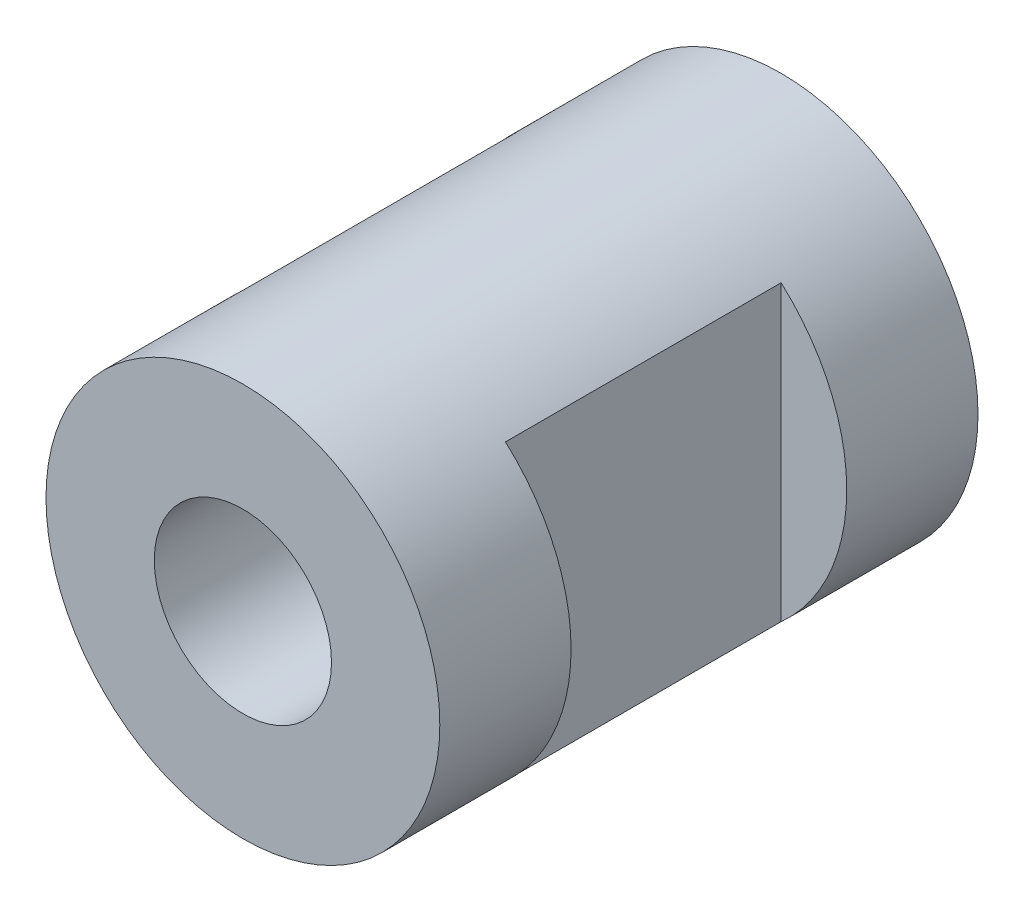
ISO-10303-21;
HEADER;
FILE_DESCRIPTION(('STEP AP214'),'2;1');
FILE_NAME('part.step','',(''),(''),'','','');
FILE_SCHEMA(('AUTOMOTIVE_DESIGN { 1 0 10303 214 1 1 1 1 }'));
ENDSEC;
DATA;
#1=APPLICATION_CONTEXT('core data for automotive mechanical design processes');
#2=APPLICATION_PROTOCOL_DEFINITION('international standard','automotive_design',2000,#1);
#3=PRODUCT_CONTEXT('',#1,'mechanical');
#4=PRODUCT('Part','Part','',(#3));
#5=PRODUCT_RELATED_PRODUCT_CATEGORY('part','',(#4));
#6=PRODUCT_DEFINITION_FORMATION('','',#4);
#7=PRODUCT_DEFINITION_CONTEXT('part definition',#1,'design');
#8=PRODUCT_DEFINITION('design','',#6,#7);
#9=PRODUCT_DEFINITION_SHAPE('','',#8);
#10=(LENGTH_UNIT() NAMED_UNIT(*) SI_UNIT(.MILLI.,.METRE.));
#11=(NAMED_UNIT(*) PLANE_ANGLE_UNIT() SI_UNIT($,.RADIAN.));
#12=(NAMED_UNIT(*) SI_UNIT($,.STERADIAN.) SOLID_ANGLE_UNIT());
#13=UNCERTAINTY_MEASURE_WITH_UNIT(LENGTH_MEASURE(1.E-05),#10,'distance_accuracy_value','');
#14=(GEOMETRIC_REPRESENTATION_CONTEXT(3) GLOBAL_UNCERTAINTY_ASSIGNED_CONTEXT((#13)) GLOBAL_UNIT_ASSIGNED_CONTEXT((#10,
#11,#12)) REPRESENTATION_CONTEXT('',''));
#15=CARTESIAN_POINT('',(0.,0.,0.));
#16=DIRECTION('',(0.,0.,1.));
#17=DIRECTION('',(1.,0.,0.));
#18=AXIS2_PLACEMENT_3D('',#15,#16,#17);
#19=CARTESIAN_POINT('',(0.,0.,20.5));
#20=DIRECTION('',(0.,0.,1.));
#21=DIRECTION('',(1.,0.,0.));
#22=AXIS2_PLACEMENT_3D('',#19,#20,#21);
#23=PLANE('',#22);
#24=CARTESIAN_POINT('',(0.,0.,20.5));
#25=DIRECTION('',(0.,0.,1.));
#26=DIRECTION('',(1.,0.,0.));
#27=AXIS2_PLACEMENT_3D('',#24,#25,#26);
#28=CIRCLE('',#27,7.5);
#29=CARTESIAN_POINT('',(7.5,0.,20.5));
#30=VERTEX_POINT('',#29);
#31=EDGE_CURVE('E99',#30,#30,#28,.T.);
#32=ORIENTED_EDGE('',*,*,#31,.T.);
#33=EDGE_LOOP('',(#32));
#34=FACE_BOUND('',#33,.T.);
#35=CARTESIAN_POINT('',(0.,0.,20.5));
#36=DIRECTION('',(0.,0.,1.));
#37=DIRECTION('',(1.,0.,0.));
#38=AXIS2_PLACEMENT_3D('',#35,#36,#37);
#39=CIRCLE('',#38,3.375);
#40=CARTESIAN_POINT('',(3.375,0.,20.5));
#41=VERTEX_POINT('',#40);
#42=EDGE_CURVE('E103',#41,#41,#39,.T.);
#43=ORIENTED_EDGE('',*,*,#42,.F.);
#44=EDGE_LOOP('',(#43));
#45=FACE_BOUND('',#44,.T.);
#46=ADVANCED_FACE('F32',(#34,#45),#23,.T.);
#47=CARTESIAN_POINT('',(0.,0.,0.));
#48=DIRECTION('',(0.,0.,1.));
#49=DIRECTION('',(1.,0.,0.));
#50=AXIS2_PLACEMENT_3D('',#47,#48,#49);
#51=PLANE('',#50);
#52=CARTESIAN_POINT('',(0.,0.,0.));
#53=DIRECTION('',(0.,0.,1.));
#54=DIRECTION('',(1.,0.,0.));
#55=AXIS2_PLACEMENT_3D('',#52,#53,#54);
#56=CIRCLE('',#55,7.5);
#57=CARTESIAN_POINT('',(7.5,0.,0.));
#58=VERTEX_POINT('',#57);
#59=EDGE_CURVE('E100',#58,#58,#56,.T.);
#60=ORIENTED_EDGE('',*,*,#59,.F.);
#61=EDGE_LOOP('',(#60));
#62=FACE_BOUND('',#61,.T.);
#63=CARTESIAN_POINT('',(0.,0.,0.));
#64=DIRECTION('',(0.,0.,1.));
#65=DIRECTION('',(1.,0.,0.));
#66=AXIS2_PLACEMENT_3D('',#63,#64,#65);
#67=CIRCLE('',#66,3.375);
#68=CARTESIAN_POINT('',(3.375,0.,0.));
#69=VERTEX_POINT('',#68);
#70=EDGE_CURVE('E106',#69,#69,#67,.T.);
#71=ORIENTED_EDGE('',*,*,#70,.T.);
#72=EDGE_LOOP('',(#71));
#73=FACE_BOUND('',#72,.T.);
#74=ADVANCED_FACE('F128',(#62,#73),#51,.F.);
#75=CARTESIAN_POINT('',(0.,0.,20.5));
#76=DIRECTION('',(0.,0.,-1.));
#77=DIRECTION('',(-1.,0.,0.));
#78=AXIS2_PLACEMENT_3D('',#75,#76,#77);
#79=CYLINDRICAL_SURFACE('',#78,7.5);
#80=DIRECTION('',(0.,0.,-1.));
#81=VECTOR('',#80,1.);
#82=CARTESIAN_POINT('',(-5.,-5.59016994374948,20.5));
#83=LINE('',#82,#81);
#84=CARTESIAN_POINT('',(-5.,-5.59016994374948,15.5));
#85=VERTEX_POINT('',#84);
#86=CARTESIAN_POINT('',(-5.,-5.59016994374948,5.));
#87=VERTEX_POINT('',#86);
#88=EDGE_CURVE('E40',#85,#87,#83,.T.);
#89=ORIENTED_EDGE('',*,*,#88,.T.);
#90=CARTESIAN_POINT('',(0.,0.,5.));
#91=DIRECTION('',(0.,0.,-1.));
#92=DIRECTION('',(-1.,0.,0.));
#93=AXIS2_PLACEMENT_3D('',#90,#91,#92);
#94=CIRCLE('',#93,7.5);
#95=CARTESIAN_POINT('',(-5.,5.59016994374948,5.));
#96=VERTEX_POINT('',#95);
#97=EDGE_CURVE('E11',#87,#96,#94,.T.);
#98=ORIENTED_EDGE('',*,*,#97,.T.);
#99=DIRECTION('',(0.,0.,-1.));
#100=VECTOR('',#99,1.);
#101=CARTESIAN_POINT('',(-5.,5.59016994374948,20.5));
#102=LINE('',#101,#100);
#103=CARTESIAN_POINT('',(-5.,5.59016994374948,15.5));
#104=VERTEX_POINT('',#103);
#105=EDGE_CURVE('E76',#96,#104,#102,.F.);
#106=ORIENTED_EDGE('',*,*,#105,.T.);
#107=CARTESIAN_POINT('',(0.,0.,15.5));
#108=DIRECTION('',(0.,0.,1.));
#109=DIRECTION('',(1.,0.,0.));
#110=AXIS2_PLACEMENT_3D('',#107,#108,#109);
#111=CIRCLE('',#110,7.5);
#112=EDGE_CURVE('E71',#104,#85,#111,.T.);
#113=ORIENTED_EDGE('',*,*,#112,.T.);
#114=EDGE_LOOP('',(#89,#98,#106,#113));
#115=FACE_BOUND('',#114,.T.);
#116=DIRECTION('',(0.,0.,-1.));
#117=VECTOR('',#116,1.);
#118=CARTESIAN_POINT('',(5.,-5.59016994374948,20.5));
#119=LINE('',#118,#117);
#120=CARTESIAN_POINT('',(5.,-5.59016994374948,5.));
#121=VERTEX_POINT('',#120);
#122=CARTESIAN_POINT('',(5.,-5.59016994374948,15.5));
#123=VERTEX_POINT('',#122);
#124=EDGE_CURVE('E93',#121,#123,#119,.F.);
#125=ORIENTED_EDGE('',*,*,#124,.T.);
#126=CARTESIAN_POINT('',(0.,0.,15.5));
#127=DIRECTION('',(0.,0.,1.));
#128=DIRECTION('',(1.,0.,0.));
#129=AXIS2_PLACEMENT_3D('',#126,#127,#128);
#130=CIRCLE('',#129,7.5);
#131=CARTESIAN_POINT('',(5.,5.59016994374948,15.5));
#132=VERTEX_POINT('',#131);
#133=EDGE_CURVE('E77',#123,#132,#130,.T.);
#134=ORIENTED_EDGE('',*,*,#133,.T.);
#135=DIRECTION('',(0.,0.,-1.));
#136=VECTOR('',#135,1.);
#137=CARTESIAN_POINT('',(5.,5.59016994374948,20.5));
#138=LINE('',#137,#136);
#139=CARTESIAN_POINT('',(5.,5.59016994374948,5.));
#140=VERTEX_POINT('',#139);
#141=EDGE_CURVE('E90',#132,#140,#138,.T.);
#142=ORIENTED_EDGE('',*,*,#141,.T.);
#143=CARTESIAN_POINT('',(0.,0.,5.));
#144=DIRECTION('',(0.,0.,-1.));
#145=DIRECTION('',(-1.,0.,0.));
#146=AXIS2_PLACEMENT_3D('',#143,#144,#145);
#147=CIRCLE('',#146,7.5);
#148=EDGE_CURVE('E96',#140,#121,#147,.T.);
#149=ORIENTED_EDGE('',*,*,#148,.T.);
#150=EDGE_LOOP('',(#125,#134,#142,#149));
#151=FACE_BOUND('',#150,.T.);
#152=ORIENTED_EDGE('',*,*,#31,.F.);
#153=EDGE_LOOP('',(#152));
#154=FACE_BOUND('',#153,.T.);
#155=ORIENTED_EDGE('',*,*,#59,.T.);
#156=EDGE_LOOP('',(#155));
#157=FACE_BOUND('',#156,.T.);
#158=ADVANCED_FACE('F34',(#115,#151,#154,#157),#79,.T.);
#159=CARTESIAN_POINT('',(0.,0.,20.5));
#160=DIRECTION('',(0.,0.,-1.));
#161=DIRECTION('',(-1.,0.,0.));
#162=AXIS2_PLACEMENT_3D('',#159,#160,#161);
#163=CYLINDRICAL_SURFACE('',#162,3.375);
#164=ORIENTED_EDGE('',*,*,#42,.T.);
#165=EDGE_LOOP('',(#164));
#166=FACE_BOUND('',#165,.T.);
#167=ORIENTED_EDGE('',*,*,#70,.F.);
#168=EDGE_LOOP('',(#167));
#169=FACE_BOUND('',#168,.T.);
#170=ADVANCED_FACE('F137',(#166,#169),#163,.F.);
#171=CARTESIAN_POINT('',(8.59956619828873,-13.,15.5));
#172=DIRECTION('',(0.,0.,1.));
#173=DIRECTION('',(1.,0.,0.));
#174=AXIS2_PLACEMENT_3D('',#171,#172,#173);
#175=PLANE('',#174);
#176=DIRECTION('',(0.,1.,0.));
#177=VECTOR('',#176,1.);
#178=CARTESIAN_POINT('',(5.,-13.,15.5));
#179=LINE('',#178,#177);
#180=EDGE_CURVE('E109',#123,#132,#179,.T.);
#181=ORIENTED_EDGE('',*,*,#180,.T.);
#182=ORIENTED_EDGE('',*,*,#133,.F.);
#183=EDGE_LOOP('',(#181,#182));
#184=FACE_BOUND('',#183,.T.);
#185=ADVANCED_FACE('F139',(#184),#175,.F.);
#186=CARTESIAN_POINT('',(5.,-13.,15.5));
#187=DIRECTION('',(-1.,0.,0.));
#188=DIRECTION('',(0.,0.,1.));
#189=AXIS2_PLACEMENT_3D('',#186,#187,#188);
#190=PLANE('',#189);
#191=ORIENTED_EDGE('',*,*,#180,.F.);
#192=ORIENTED_EDGE('',*,*,#124,.F.);
#193=DIRECTION('',(0.,1.,0.));
#194=VECTOR('',#193,1.);
#195=CARTESIAN_POINT('',(5.,-13.,5.));
#196=LINE('',#195,#194);
#197=EDGE_CURVE('E53',#121,#140,#196,.T.);
#198=ORIENTED_EDGE('',*,*,#197,.T.);
#199=ORIENTED_EDGE('',*,*,#141,.F.);
#200=EDGE_LOOP('',(#191,#192,#198,#199));
#201=FACE_BOUND('',#200,.T.);
#202=ADVANCED_FACE('F125',(#201),#190,.F.);
#203=CARTESIAN_POINT('',(8.59956619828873,-13.,5.));
#204=DIRECTION('',(0.,0.,-1.));
#205=DIRECTION('',(-1.,0.,0.));
#206=AXIS2_PLACEMENT_3D('',#203,#204,#205);
#207=PLANE('',#206);
#208=ORIENTED_EDGE('',*,*,#197,.F.);
#209=ORIENTED_EDGE('',*,*,#148,.F.);
#210=EDGE_LOOP('',(#208,#209));
#211=FACE_BOUND('',#210,.T.);
#212=ADVANCED_FACE('F118',(#211),#207,.F.);
#213=CARTESIAN_POINT('',(-8.59956619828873,-13.,5.));
#214=DIRECTION('',(0.,0.,-1.));
#215=DIRECTION('',(-1.,0.,0.));
#216=AXIS2_PLACEMENT_3D('',#213,#214,#215);
#217=PLANE('',#216);
#218=DIRECTION('',(0.,1.,0.));
#219=VECTOR('',#218,1.);
#220=CARTESIAN_POINT('',(-5.,-13.,5.));
#221=LINE('',#220,#219);
#222=EDGE_CURVE('E83',#87,#96,#221,.T.);
#223=ORIENTED_EDGE('',*,*,#222,.T.);
#224=ORIENTED_EDGE('',*,*,#97,.F.);
#225=EDGE_LOOP('',(#223,#224));
#226=FACE_BOUND('',#225,.T.);
#227=ADVANCED_FACE('F116',(#226),#217,.F.);
#228=CARTESIAN_POINT('',(-5.,-13.,15.5));
#229=DIRECTION('',(1.,0.,0.));
#230=DIRECTION('',(0.,0.,-1.));
#231=AXIS2_PLACEMENT_3D('',#228,#229,#230);
#232=PLANE('',#231);
#233=DIRECTION('',(0.,1.,0.));
#234=VECTOR('',#233,1.);
#235=CARTESIAN_POINT('',(-5.,-13.,15.5));
#236=LINE('',#235,#234);
#237=EDGE_CURVE('E46',#85,#104,#236,.T.);
#238=ORIENTED_EDGE('',*,*,#237,.T.);
#239=ORIENTED_EDGE('',*,*,#105,.F.);
#240=ORIENTED_EDGE('',*,*,#222,.F.);
#241=ORIENTED_EDGE('',*,*,#88,.F.);
#242=EDGE_LOOP('',(#238,#239,#240,#241));
#243=FACE_BOUND('',#242,.T.);
#244=ADVANCED_FACE('F80',(#243),#232,.F.);
#245=CARTESIAN_POINT('',(-8.59956619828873,-13.,15.5));
#246=DIRECTION('',(0.,0.,1.));
#247=DIRECTION('',(1.,0.,0.));
#248=AXIS2_PLACEMENT_3D('',#245,#246,#247);
#249=PLANE('',#248);
#250=ORIENTED_EDGE('',*,*,#237,.F.);
#251=ORIENTED_EDGE('',*,*,#112,.F.);
#252=EDGE_LOOP('',(#250,#251));
#253=FACE_BOUND('',#252,.T.);
#254=ADVANCED_FACE('F72',(#253),#249,.F.);
#255=CLOSED_SHELL('',(#46,#74,#158,#170,#185,#202,#212,#227,#244,#254));
#256=MANIFOLD_SOLID_BREP('B2',#255);
#257=ADVANCED_BREP_SHAPE_REPRESENTATION('',(#18,#256),#14);
#258=SHAPE_DEFINITION_REPRESENTATION(#9,#257);
ENDSEC;
END-ISO-10303-21;
